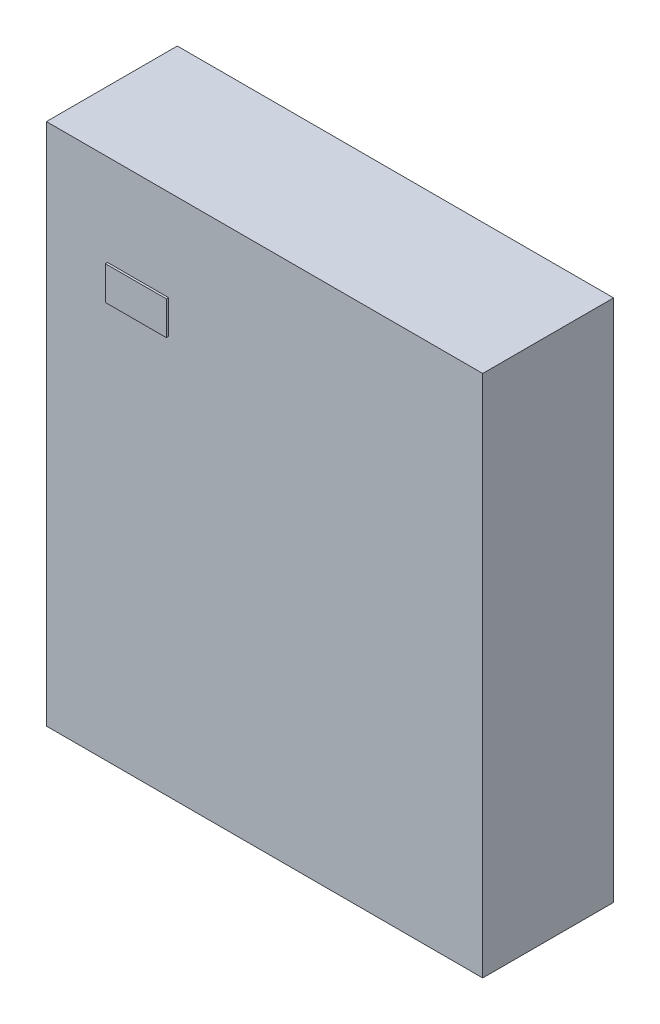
from build123d import *

# Parameters (mm, degrees)
ESQUISSE2_W                                 = 1000
ESQUISSE2_H                                 = 300
EXTRUSION1_DEPTH                            = 1200
DIAM_TRE_DU_PER_AGE_M10_0_10_000000_1_D     = 10
DIAM_TRE_DU_PER_AGE_M10_0_10_000000_1_DEPTH = 20
DIAM_TRE_DU_PER_AGE_M10_0_10_000000_1_TIP   = 3.004303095
ENL_V_MAT_EXTRU_1_DEPTH                     = 3
ESQUISSE6_W                                 = 140
ESQUISSE6_H                                 = 77
EXTRUSION2_DEPTH                            = 5


with BuildPart() as part:
    # Esquisse2 → Extrusion1 (new body)
    with BuildSketch(Plane(origin=(0, 0, 0), x_dir=(1, 0, 0), z_dir=(0, 1, 0))):
        with Locations((0, -150)):
            Rectangle(ESQUISSE2_W, ESQUISSE2_H)
    extrude(amount=EXTRUSION1_DEPTH)

    # Diam_tre du per_age M10.0 _10.000000_1
    with Locations(Plane(origin=(0, 0, 0), x_dir=(-1, 0, 0), z_dir=(0, 0, -1))):
        with Locations((-477.5, 1177.5), (477.5, 1177.5), (477.5, 22.5), (-477.5, 22.5)):
            Hole(DIAM_TRE_DU_PER_AGE_M10_0_10_000000_1_D / 2, depth=DIAM_TRE_DU_PER_AGE_M10_0_10_000000_1_DEPTH)
            with Locations((0, 0, -(DIAM_TRE_DU_PER_AGE_M10_0_10_000000_1_DEPTH + DIAM_TRE_DU_PER_AGE_M10_0_10_000000_1_TIP / 2))):  # 118° drill point
                Cone(0, DIAM_TRE_DU_PER_AGE_M10_0_10_000000_1_D / 2, DIAM_TRE_DU_PER_AGE_M10_0_10_000000_1_TIP, mode=Mode.SUBTRACT)

    # Esquisse5 → Enl_v. mat.-Extru.1 (cut)
    with BuildSketch(Plane.XZ):
        with BuildLine():
            Line((450, 45), (50, 45))
            ThreePointArc((50, 45), (32.32233047, 52.32233047), (25, 70))
            Line((25, 70), (25, 155))
            ThreePointArc((25, 155), (32.32233047, 172.67766953), (50, 180))
            Line((50, 180), (450, 180))
            ThreePointArc((450, 180), (467.67766953, 172.67766953), (475, 155))
            Line((475, 155), (475, 70))
            ThreePointArc((475, 70), (467.67766953, 52.32233047), (450, 45))
        make_face()
        with BuildLine():
            Line((-50, 45), (-450, 45))
            ThreePointArc((-450, 45), (-467.67766953, 52.32233047), (-475, 70))
            Line((-475, 70), (-475, 155))
            ThreePointArc((-475, 155), (-467.67766953, 172.67766953), (-450, 180))
            Line((-450, 180), (-50, 180))
            ThreePointArc((-50, 180), (-32.32233047, 172.67766953), (-25, 155))
            Line((-25, 155), (-25, 70))
            ThreePointArc((-25, 70), (-32.32233047, 52.32233047), (-50, 45))
        make_face()
    extrude(amount=-ENL_V_MAT_EXTRU_1_DEPTH, mode=Mode.SUBTRACT)

    # Esquisse6 → Extrusion2 (add)
    with BuildSketch(Plane.XY.offset(300)):
        with Locations((-290, 952)):
            Rectangle(ESQUISSE6_W, ESQUISSE6_H)
    extrude(amount=EXTRUSION2_DEPTH)


solid = part.part
